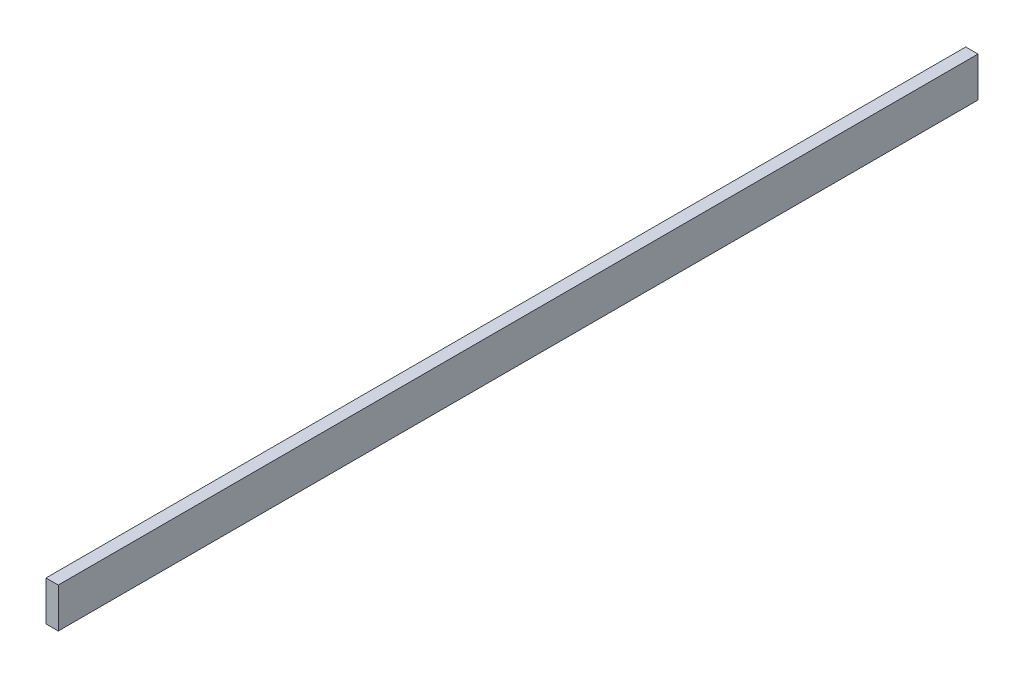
ISO-10303-21;
HEADER;
FILE_DESCRIPTION(('STEP AP214'),'2;1');
FILE_NAME('part.step','',(''),(''),'','','');
FILE_SCHEMA(('AUTOMOTIVE_DESIGN { 1 0 10303 214 1 1 1 1 }'));
ENDSEC;
DATA;
#1=APPLICATION_CONTEXT('core data for automotive mechanical design processes');
#2=APPLICATION_PROTOCOL_DEFINITION('international standard','automotive_design',2000,#1);
#3=PRODUCT_CONTEXT('',#1,'mechanical');
#4=PRODUCT('Part','Part','',(#3));
#5=PRODUCT_RELATED_PRODUCT_CATEGORY('part','',(#4));
#6=PRODUCT_DEFINITION_FORMATION('','',#4);
#7=PRODUCT_DEFINITION_CONTEXT('part definition',#1,'design');
#8=PRODUCT_DEFINITION('design','',#6,#7);
#9=PRODUCT_DEFINITION_SHAPE('','',#8);
#10=(LENGTH_UNIT() NAMED_UNIT(*) SI_UNIT(.MILLI.,.METRE.));
#11=(NAMED_UNIT(*) PLANE_ANGLE_UNIT() SI_UNIT($,.RADIAN.));
#12=(NAMED_UNIT(*) SI_UNIT($,.STERADIAN.) SOLID_ANGLE_UNIT());
#13=UNCERTAINTY_MEASURE_WITH_UNIT(LENGTH_MEASURE(1.E-05),#10,'distance_accuracy_value','');
#14=(GEOMETRIC_REPRESENTATION_CONTEXT(3) GLOBAL_UNCERTAINTY_ASSIGNED_CONTEXT((#13)) GLOBAL_UNIT_ASSIGNED_CONTEXT((#10,
#11,#12)) REPRESENTATION_CONTEXT('',''));
#15=CARTESIAN_POINT('',(0.,0.,0.));
#16=DIRECTION('',(0.,0.,1.));
#17=DIRECTION('',(1.,0.,0.));
#18=AXIS2_PLACEMENT_3D('',#15,#16,#17);
#19=CARTESIAN_POINT('',(-2.,6.5,150.));
#20=DIRECTION('',(1.,0.,0.));
#21=DIRECTION('',(0.,0.,-1.));
#22=AXIS2_PLACEMENT_3D('',#19,#20,#21);
#23=PLANE('',#22);
#24=DIRECTION('',(0.,-1.,0.));
#25=VECTOR('',#24,1.);
#26=CARTESIAN_POINT('',(-2.,6.5,-150.));
#27=LINE('',#26,#25);
#28=CARTESIAN_POINT('',(-2.,6.5,-150.));
#29=VERTEX_POINT('',#28);
#30=CARTESIAN_POINT('',(-2.,-6.5,-150.));
#31=VERTEX_POINT('',#30);
#32=EDGE_CURVE('E74',#29,#31,#27,.T.);
#33=ORIENTED_EDGE('',*,*,#32,.T.);
#34=DIRECTION('',(0.,0.,-1.));
#35=VECTOR('',#34,1.);
#36=CARTESIAN_POINT('',(-2.,-6.5,150.));
#37=LINE('',#36,#35);
#38=CARTESIAN_POINT('',(-2.,-6.5,150.));
#39=VERTEX_POINT('',#38);
#40=EDGE_CURVE('E11',#39,#31,#37,.T.);
#41=ORIENTED_EDGE('',*,*,#40,.F.);
#42=DIRECTION('',(0.,-1.,0.));
#43=VECTOR('',#42,1.);
#44=CARTESIAN_POINT('',(-2.,6.5,150.));
#45=LINE('',#44,#43);
#46=CARTESIAN_POINT('',(-2.,6.5,150.));
#47=VERTEX_POINT('',#46);
#48=EDGE_CURVE('E92',#47,#39,#45,.T.);
#49=ORIENTED_EDGE('',*,*,#48,.F.);
#50=DIRECTION('',(0.,0.,-1.));
#51=VECTOR('',#50,1.);
#52=CARTESIAN_POINT('',(-2.,6.5,150.));
#53=LINE('',#52,#51);
#54=EDGE_CURVE('E86',#47,#29,#53,.T.);
#55=ORIENTED_EDGE('',*,*,#54,.T.);
#56=EDGE_LOOP('',(#33,#41,#49,#55));
#57=FACE_BOUND('',#56,.T.);
#58=ADVANCED_FACE('F30',(#57),#23,.F.);
#59=CARTESIAN_POINT('',(-2.,-6.5,150.));
#60=DIRECTION('',(0.,1.,0.));
#61=DIRECTION('',(0.,0.,1.));
#62=AXIS2_PLACEMENT_3D('',#59,#60,#61);
#63=PLANE('',#62);
#64=DIRECTION('',(1.,0.,0.));
#65=VECTOR('',#64,1.);
#66=CARTESIAN_POINT('',(-2.,-6.5,-150.));
#67=LINE('',#66,#65);
#68=CARTESIAN_POINT('',(2.,-6.5,-150.));
#69=VERTEX_POINT('',#68);
#70=EDGE_CURVE('E70',#31,#69,#67,.T.);
#71=ORIENTED_EDGE('',*,*,#70,.T.);
#72=DIRECTION('',(0.,0.,-1.));
#73=VECTOR('',#72,1.);
#74=CARTESIAN_POINT('',(2.,-6.5,150.));
#75=LINE('',#74,#73);
#76=CARTESIAN_POINT('',(2.,-6.5,150.));
#77=VERTEX_POINT('',#76);
#78=EDGE_CURVE('E37',#77,#69,#75,.T.);
#79=ORIENTED_EDGE('',*,*,#78,.F.);
#80=DIRECTION('',(1.,0.,0.));
#81=VECTOR('',#80,1.);
#82=CARTESIAN_POINT('',(-2.,-6.5,150.));
#83=LINE('',#82,#81);
#84=EDGE_CURVE('E82',#39,#77,#83,.T.);
#85=ORIENTED_EDGE('',*,*,#84,.F.);
#86=ORIENTED_EDGE('',*,*,#40,.T.);
#87=EDGE_LOOP('',(#71,#79,#85,#86));
#88=FACE_BOUND('',#87,.T.);
#89=ADVANCED_FACE('F81',(#88),#63,.F.);
#90=CARTESIAN_POINT('',(2.,6.5,150.));
#91=DIRECTION('',(-1.,0.,0.));
#92=DIRECTION('',(0.,0.,1.));
#93=AXIS2_PLACEMENT_3D('',#90,#91,#92);
#94=PLANE('',#93);
#95=DIRECTION('',(0.,1.,0.));
#96=VECTOR('',#95,1.);
#97=CARTESIAN_POINT('',(2.,6.5,-150.));
#98=LINE('',#97,#96);
#99=CARTESIAN_POINT('',(2.,6.5,-150.));
#100=VERTEX_POINT('',#99);
#101=EDGE_CURVE('E75',#69,#100,#98,.T.);
#102=ORIENTED_EDGE('',*,*,#101,.T.);
#103=DIRECTION('',(0.,0.,-1.));
#104=VECTOR('',#103,1.);
#105=CARTESIAN_POINT('',(2.,6.5,150.));
#106=LINE('',#105,#104);
#107=CARTESIAN_POINT('',(2.,6.5,150.));
#108=VERTEX_POINT('',#107);
#109=EDGE_CURVE('E98',#108,#100,#106,.T.);
#110=ORIENTED_EDGE('',*,*,#109,.F.);
#111=DIRECTION('',(0.,1.,0.));
#112=VECTOR('',#111,1.);
#113=CARTESIAN_POINT('',(2.,6.5,150.));
#114=LINE('',#113,#112);
#115=EDGE_CURVE('E49',#77,#108,#114,.T.);
#116=ORIENTED_EDGE('',*,*,#115,.F.);
#117=ORIENTED_EDGE('',*,*,#78,.T.);
#118=EDGE_LOOP('',(#102,#110,#116,#117));
#119=FACE_BOUND('',#118,.T.);
#120=ADVANCED_FACE('F101',(#119),#94,.F.);
#121=CARTESIAN_POINT('',(-2.,6.5,150.));
#122=DIRECTION('',(0.,-1.,0.));
#123=DIRECTION('',(0.,0.,-1.));
#124=AXIS2_PLACEMENT_3D('',#121,#122,#123);
#125=PLANE('',#124);
#126=DIRECTION('',(-1.,0.,0.));
#127=VECTOR('',#126,1.);
#128=CARTESIAN_POINT('',(-2.,6.5,-150.));
#129=LINE('',#128,#127);
#130=EDGE_CURVE('E90',#100,#29,#129,.T.);
#131=ORIENTED_EDGE('',*,*,#130,.T.);
#132=ORIENTED_EDGE('',*,*,#54,.F.);
#133=DIRECTION('',(-1.,0.,0.));
#134=VECTOR('',#133,1.);
#135=CARTESIAN_POINT('',(-2.,6.5,150.));
#136=LINE('',#135,#134);
#137=EDGE_CURVE('E44',#108,#47,#136,.T.);
#138=ORIENTED_EDGE('',*,*,#137,.F.);
#139=ORIENTED_EDGE('',*,*,#109,.T.);
#140=EDGE_LOOP('',(#131,#132,#138,#139));
#141=FACE_BOUND('',#140,.T.);
#142=ADVANCED_FACE('F103',(#141),#125,.F.);
#143=CARTESIAN_POINT('',(-2.,-6.5,150.));
#144=DIRECTION('',(0.,0.,1.));
#145=DIRECTION('',(1.,0.,0.));
#146=AXIS2_PLACEMENT_3D('',#143,#144,#145);
#147=PLANE('',#146);
#148=ORIENTED_EDGE('',*,*,#48,.T.);
#149=ORIENTED_EDGE('',*,*,#84,.T.);
#150=ORIENTED_EDGE('',*,*,#115,.T.);
#151=ORIENTED_EDGE('',*,*,#137,.T.);
#152=EDGE_LOOP('',(#148,#149,#150,#151));
#153=FACE_BOUND('',#152,.T.);
#154=ADVANCED_FACE('F104',(#153),#147,.T.);
#155=CARTESIAN_POINT('',(-2.,-6.5,-150.));
#156=DIRECTION('',(0.,0.,1.));
#157=DIRECTION('',(1.,0.,0.));
#158=AXIS2_PLACEMENT_3D('',#155,#156,#157);
#159=PLANE('',#158);
#160=ORIENTED_EDGE('',*,*,#32,.F.);
#161=ORIENTED_EDGE('',*,*,#130,.F.);
#162=ORIENTED_EDGE('',*,*,#101,.F.);
#163=ORIENTED_EDGE('',*,*,#70,.F.);
#164=EDGE_LOOP('',(#160,#161,#162,#163));
#165=FACE_BOUND('',#164,.T.);
#166=ADVANCED_FACE('F71',(#165),#159,.F.);
#167=CLOSED_SHELL('',(#58,#89,#120,#142,#154,#166));
#168=MANIFOLD_SOLID_BREP('B2',#167);
#169=ADVANCED_BREP_SHAPE_REPRESENTATION('',(#18,#168),#14);
#170=SHAPE_DEFINITION_REPRESENTATION(#9,#169);
ENDSEC;
END-ISO-10303-21;
